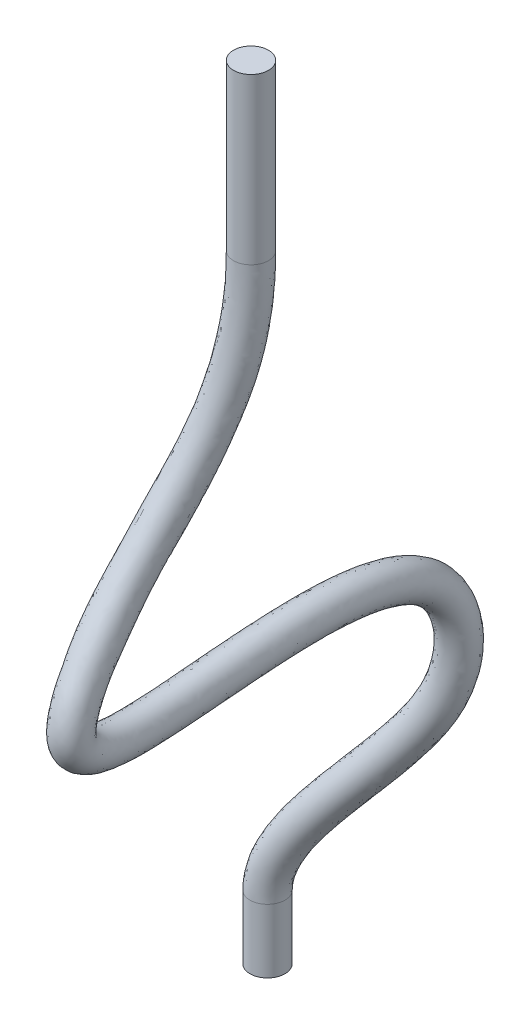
ISO-10303-21;
HEADER;
FILE_DESCRIPTION(('STEP AP214'),'2;1');
FILE_NAME('part.step','',(''),(''),'','','');
FILE_SCHEMA(('AUTOMOTIVE_DESIGN { 1 0 10303 214 1 1 1 1 }'));
ENDSEC;
DATA;
#1=APPLICATION_CONTEXT('core data for automotive mechanical design processes');
#2=APPLICATION_PROTOCOL_DEFINITION('international standard','automotive_design',2000,#1);
#3=PRODUCT_CONTEXT('',#1,'mechanical');
#4=PRODUCT('Part','Part','',(#3));
#5=PRODUCT_RELATED_PRODUCT_CATEGORY('part','',(#4));
#6=PRODUCT_DEFINITION_FORMATION('','',#4);
#7=PRODUCT_DEFINITION_CONTEXT('part definition',#1,'design');
#8=PRODUCT_DEFINITION('design','',#6,#7);
#9=PRODUCT_DEFINITION_SHAPE('','',#8);
#10=(LENGTH_UNIT() NAMED_UNIT(*) SI_UNIT(.MILLI.,.METRE.));
#11=(NAMED_UNIT(*) PLANE_ANGLE_UNIT() SI_UNIT($,.RADIAN.));
#12=(NAMED_UNIT(*) SI_UNIT($,.STERADIAN.) SOLID_ANGLE_UNIT());
#13=UNCERTAINTY_MEASURE_WITH_UNIT(LENGTH_MEASURE(1.E-05),#10,'distance_accuracy_value','');
#14=(GEOMETRIC_REPRESENTATION_CONTEXT(3) GLOBAL_UNCERTAINTY_ASSIGNED_CONTEXT((#13)) GLOBAL_UNIT_ASSIGNED_CONTEXT((#10,
#11,#12)) REPRESENTATION_CONTEXT('',''));
#15=CARTESIAN_POINT('',(0.,0.,0.));
#16=DIRECTION('',(0.,0.,1.));
#17=DIRECTION('',(1.,0.,0.));
#18=AXIS2_PLACEMENT_3D('',#15,#16,#17);
#19=CARTESIAN_POINT('',(-11.9145270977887,-65.5887144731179,-11.1066057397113));
#20=DIRECTION('',(0.,-1.,0.));
#21=DIRECTION('',(0.,0.,-1.));
#22=AXIS2_PLACEMENT_3D('',#19,#20,#21);
#23=CYLINDRICAL_SURFACE('',#22,1.);
#24=CARTESIAN_POINT('',(-11.9145270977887,-65.5887144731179,-11.1066057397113));
#25=DIRECTION('',(0.,1.,0.));
#26=DIRECTION('',(-0.731338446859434,0.,0.682014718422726));
#27=AXIS2_PLACEMENT_3D('',#24,#25,#26);
#28=CIRCLE('',#27,1.);
#29=CARTESIAN_POINT('',(-11.9145270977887,-65.5887144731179,-12.1066057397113));
#30=VERTEX_POINT('',#29);
#31=EDGE_CURVE('E63',#30,#30,#28,.T.);
#32=CARTESIAN_POINT('',(-11.9145270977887,-69.2384942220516,-11.1066057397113));
#33=DIRECTION('',(0.,1.,0.));
#34=DIRECTION('',(-0.731338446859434,0.,0.682014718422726));
#35=AXIS2_PLACEMENT_3D('',#32,#33,#34);
#36=CIRCLE('',#35,1.);
#37=CARTESIAN_POINT('',(-11.9145270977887,-69.2384942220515,-12.1066057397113));
#38=VERTEX_POINT('',#37);
#39=EDGE_CURVE('E11',#38,#38,#36,.T.);
#40=CARTESIAN_POINT('',(-11.9145270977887,-65.5887144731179,-12.1066057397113));
#41=CARTESIAN_POINT('',(-11.9145270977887,-65.6267330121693,-12.1066057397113));
#42=CARTESIAN_POINT('',(-11.9145270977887,-65.6647515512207,-12.1066057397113));
#43=CARTESIAN_POINT('',(-11.9145270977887,-65.7407886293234,-12.1066057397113));
#44=CARTESIAN_POINT('',(-11.9145270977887,-65.7788071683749,-12.1066057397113));
#45=CARTESIAN_POINT('',(-11.9145270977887,-65.8548442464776,-12.1066057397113));
#46=CARTESIAN_POINT('',(-11.9145270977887,-65.892862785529,-12.1066057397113));
#47=CARTESIAN_POINT('',(-11.9145270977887,-65.9688998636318,-12.1066057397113));
#48=CARTESIAN_POINT('',(-11.9145270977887,-66.0069184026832,-12.1066057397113));
#49=CARTESIAN_POINT('',(-11.9145270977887,-66.082955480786,-12.1066057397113));
#50=CARTESIAN_POINT('',(-11.9145270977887,-66.1209740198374,-12.1066057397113));
#51=CARTESIAN_POINT('',(-11.9145270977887,-66.1970110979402,-12.1066057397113));
#52=CARTESIAN_POINT('',(-11.9145270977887,-66.2350296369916,-12.1066057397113));
#53=CARTESIAN_POINT('',(-11.9145270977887,-66.3110667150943,-12.1066057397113));
#54=CARTESIAN_POINT('',(-11.9145270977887,-66.3490852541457,-12.1066057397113));
#55=CARTESIAN_POINT('',(-11.9145270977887,-66.4251223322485,-12.1066057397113));
#56=CARTESIAN_POINT('',(-11.9145270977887,-66.4631408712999,-12.1066057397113));
#57=CARTESIAN_POINT('',(-11.9145270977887,-66.5391779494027,-12.1066057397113));
#58=CARTESIAN_POINT('',(-11.9145270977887,-66.5771964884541,-12.1066057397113));
#59=CARTESIAN_POINT('',(-11.9145270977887,-66.6532335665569,-12.1066057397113));
#60=CARTESIAN_POINT('',(-11.9145270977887,-66.6912521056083,-12.1066057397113));
#61=CARTESIAN_POINT('',(-11.9145270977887,-66.767289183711,-12.1066057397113));
#62=CARTESIAN_POINT('',(-11.9145270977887,-66.8053077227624,-12.1066057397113));
#63=CARTESIAN_POINT('',(-11.9145270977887,-66.8813448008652,-12.1066057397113));
#64=CARTESIAN_POINT('',(-11.9145270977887,-66.9193633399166,-12.1066057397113));
#65=CARTESIAN_POINT('',(-11.9145270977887,-66.9954004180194,-12.1066057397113));
#66=CARTESIAN_POINT('',(-11.9145270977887,-67.0334189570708,-12.1066057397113));
#67=CARTESIAN_POINT('',(-11.9145270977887,-67.1094560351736,-12.1066057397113));
#68=CARTESIAN_POINT('',(-11.9145270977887,-67.147474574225,-12.1066057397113));
#69=CARTESIAN_POINT('',(-11.9145270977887,-67.2235116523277,-12.1066057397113));
#70=CARTESIAN_POINT('',(-11.9145270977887,-67.2615301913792,-12.1066057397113));
#71=CARTESIAN_POINT('',(-11.9145270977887,-67.3375672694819,-12.1066057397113));
#72=CARTESIAN_POINT('',(-11.9145270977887,-67.3755858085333,-12.1066057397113));
#73=CARTESIAN_POINT('',(-11.9145270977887,-67.4516228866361,-12.1066057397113));
#74=CARTESIAN_POINT('',(-11.9145270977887,-67.4896414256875,-12.1066057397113));
#75=CARTESIAN_POINT('',(-11.9145270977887,-67.5656785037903,-12.1066057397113));
#76=CARTESIAN_POINT('',(-11.9145270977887,-67.6036970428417,-12.1066057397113));
#77=CARTESIAN_POINT('',(-11.9145270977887,-67.6797341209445,-12.1066057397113));
#78=CARTESIAN_POINT('',(-11.9145270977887,-67.7177526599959,-12.1066057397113));
#79=CARTESIAN_POINT('',(-11.9145270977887,-67.7937897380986,-12.1066057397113));
#80=CARTESIAN_POINT('',(-11.9145270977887,-67.83180827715,-12.1066057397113));
#81=CARTESIAN_POINT('',(-11.9145270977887,-67.9078453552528,-12.1066057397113));
#82=CARTESIAN_POINT('',(-11.9145270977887,-67.9458638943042,-12.1066057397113));
#83=CARTESIAN_POINT('',(-11.9145270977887,-68.021900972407,-12.1066057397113));
#84=CARTESIAN_POINT('',(-11.9145270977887,-68.0599195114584,-12.1066057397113));
#85=CARTESIAN_POINT('',(-11.9145270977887,-68.1359565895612,-12.1066057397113));
#86=CARTESIAN_POINT('',(-11.9145270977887,-68.1739751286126,-12.1066057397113));
#87=CARTESIAN_POINT('',(-11.9145270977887,-68.2500122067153,-12.1066057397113));
#88=CARTESIAN_POINT('',(-11.9145270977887,-68.2880307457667,-12.1066057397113));
#89=CARTESIAN_POINT('',(-11.9145270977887,-68.3640678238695,-12.1066057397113));
#90=CARTESIAN_POINT('',(-11.9145270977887,-68.4020863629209,-12.1066057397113));
#91=CARTESIAN_POINT('',(-11.9145270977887,-68.4781234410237,-12.1066057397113));
#92=CARTESIAN_POINT('',(-11.9145270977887,-68.5161419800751,-12.1066057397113));
#93=CARTESIAN_POINT('',(-11.9145270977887,-68.5921790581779,-12.1066057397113));
#94=CARTESIAN_POINT('',(-11.9145270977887,-68.6301975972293,-12.1066057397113));
#95=CARTESIAN_POINT('',(-11.9145270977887,-68.706234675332,-12.1066057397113));
#96=CARTESIAN_POINT('',(-11.9145270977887,-68.7442532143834,-12.1066057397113));
#97=CARTESIAN_POINT('',(-11.9145270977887,-68.8202902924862,-12.1066057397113));
#98=CARTESIAN_POINT('',(-11.9145270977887,-68.8583088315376,-12.1066057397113));
#99=CARTESIAN_POINT('',(-11.9145270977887,-68.9343459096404,-12.1066057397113));
#100=CARTESIAN_POINT('',(-11.9145270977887,-68.9723644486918,-12.1066057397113));
#101=CARTESIAN_POINT('',(-11.9145270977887,-69.0484015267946,-12.1066057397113));
#102=CARTESIAN_POINT('',(-11.9145270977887,-69.086420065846,-12.1066057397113));
#103=CARTESIAN_POINT('',(-11.9145270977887,-69.1624571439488,-12.1066057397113));
#104=CARTESIAN_POINT('',(-11.9145270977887,-69.2004756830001,-12.1066057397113));
#105=CARTESIAN_POINT('',(-11.9145270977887,-69.2384942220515,-12.1066057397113));
#106=B_SPLINE_CURVE_WITH_KNOTS('',3,(#40,#41,#42,#43,#44,#45,#46,#47,#48,#49,#50,#51,#52,#53,
#54,#55,#56,#57,#58,#59,#60,#61,#62,#63,#64,#65,#66,#67,#68,#69,#70,#71,#72,#73,#74,#75,#76,#77,
#78,#79,#80,#81,#82,#83,#84,#85,#86,#87,#88,#89,#90,#91,#92,#93,#94,#95,#96,#97,#98,#99,#100,
#101,#102,#103,#104,#105),.UNSPECIFIED.,.F.,.F.,(4,2,2,2,2,2,2,2,2,2,2,2,2,2,2,2,2,2,2,2,2,2,2,
2,2,2,2,2,2,2,2,2,4),(0.,0.114055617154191,0.228111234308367,0.342166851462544,
0.456222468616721,0.570278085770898,0.684333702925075,0.798389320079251,0.912444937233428,
1.0265005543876,1.14055617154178,1.25461178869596,1.36866740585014,1.48272302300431,
1.59677864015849,1.71083425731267,1.82488987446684,1.93894549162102,2.0530011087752,
2.16705672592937,2.28111234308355,2.39516796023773,2.5092235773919,2.62327919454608,
2.73733481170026,2.85139042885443,2.96544604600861,3.07950166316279,3.19355728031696,
3.30761289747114,3.42166851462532,3.53572413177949,3.64977974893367),.UNSPECIFIED.);
#107=EDGE_CURVE('BSEAM49',#30,#38,#106,.T.);
#108=ORIENTED_EDGE('',*,*,#31,.F.);
#109=ORIENTED_EDGE('',*,*,#39,.T.);
#110=ORIENTED_EDGE('',*,*,#107,.T.);
#111=ORIENTED_EDGE('',*,*,#107,.F.);
#112=EDGE_LOOP('',(#108,#110,#109,#111));
#113=FACE_BOUND('',#112,.T.);
#114=ADVANCED_FACE('F49',(#113),#23,.T.);
#115=CARTESIAN_POINT('',(0.,-21.51680856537,1.75));
#116=DIRECTION('',(0.,1.,0.));
#117=DIRECTION('',(-1.,0.,0.));
#118=AXIS2_PLACEMENT_3D('',#115,#116,#117);
#119=CYLINDRICAL_SURFACE('',#118,1.);
#120=CARTESIAN_POINT('',(0.,-21.51680856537,1.75));
#121=DIRECTION('',(0.,1.,0.));
#122=DIRECTION('',(0.,0.,1.));
#123=AXIS2_PLACEMENT_3D('',#120,#121,#122);
#124=CIRCLE('',#123,1.);
#125=CARTESIAN_POINT('',(-1.,-21.51680856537,1.75));
#126=VERTEX_POINT('',#125);
#127=EDGE_CURVE('E59',#126,#126,#124,.T.);
#128=CARTESIAN_POINT('',(0.,-12.0865534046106,1.75));
#129=DIRECTION('',(0.,1.,0.));
#130=DIRECTION('',(0.,0.,1.));
#131=AXIS2_PLACEMENT_3D('',#128,#129,#130);
#132=CIRCLE('',#131,1.);
#133=CARTESIAN_POINT('',(-0.999999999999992,-12.0865534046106,1.75));
#134=VERTEX_POINT('',#133);
#135=EDGE_CURVE('E55',#134,#134,#132,.T.);
#136=CARTESIAN_POINT('',(-1.,-21.51680856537,1.75));
#137=CARTESIAN_POINT('',(-1.,-21.4185767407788,1.75));
#138=CARTESIAN_POINT('',(-0.999999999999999,-21.3203449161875,1.75));
#139=CARTESIAN_POINT('',(-0.999999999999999,-21.1238812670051,1.75));
#140=CARTESIAN_POINT('',(-0.999999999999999,-21.0256494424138,1.75));
#141=CARTESIAN_POINT('',(-0.999999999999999,-20.8291857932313,1.75));
#142=CARTESIAN_POINT('',(-0.999999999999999,-20.7309539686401,1.75));
#143=CARTESIAN_POINT('',(-0.999999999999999,-20.5344903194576,1.75));
#144=CARTESIAN_POINT('',(-0.999999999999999,-20.4362584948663,1.75));
#145=CARTESIAN_POINT('',(-0.999999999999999,-20.2397948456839,1.75));
#146=CARTESIAN_POINT('',(-0.999999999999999,-20.1415630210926,1.75));
#147=CARTESIAN_POINT('',(-0.999999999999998,-19.9450993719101,1.75));
#148=CARTESIAN_POINT('',(-0.999999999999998,-19.8468675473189,1.75));
#149=CARTESIAN_POINT('',(-0.999999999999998,-19.6504038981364,1.75));
#150=CARTESIAN_POINT('',(-0.999999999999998,-19.5521720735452,1.75));
#151=CARTESIAN_POINT('',(-0.999999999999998,-19.3557084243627,1.75));
#152=CARTESIAN_POINT('',(-0.999999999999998,-19.2574765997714,1.75));
#153=CARTESIAN_POINT('',(-0.999999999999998,-19.0610129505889,1.75));
#154=CARTESIAN_POINT('',(-0.999999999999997,-18.9627811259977,1.75));
#155=CARTESIAN_POINT('',(-0.999999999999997,-18.7663174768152,1.75));
#156=CARTESIAN_POINT('',(-0.999999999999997,-18.668085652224,1.75));
#157=CARTESIAN_POINT('',(-0.999999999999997,-18.4716220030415,1.75));
#158=CARTESIAN_POINT('',(-0.999999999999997,-18.3733901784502,1.75));
#159=CARTESIAN_POINT('',(-0.999999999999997,-18.1769265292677,1.75));
#160=CARTESIAN_POINT('',(-0.999999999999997,-18.0786947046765,1.75));
#161=CARTESIAN_POINT('',(-0.999999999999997,-17.882231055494,1.75));
#162=CARTESIAN_POINT('',(-0.999999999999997,-17.7839992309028,1.75));
#163=CARTESIAN_POINT('',(-0.999999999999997,-17.5875355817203,1.75));
#164=CARTESIAN_POINT('',(-0.999999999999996,-17.489303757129,1.75));
#165=CARTESIAN_POINT('',(-0.999999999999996,-17.2928401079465,1.75));
#166=CARTESIAN_POINT('',(-0.999999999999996,-17.1946082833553,1.75));
#167=CARTESIAN_POINT('',(-0.999999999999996,-16.9981446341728,1.75));
#168=CARTESIAN_POINT('',(-0.999999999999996,-16.8999128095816,1.75));
#169=CARTESIAN_POINT('',(-0.999999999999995,-16.7034491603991,1.75));
#170=CARTESIAN_POINT('',(-0.999999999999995,-16.6052173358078,1.75));
#171=CARTESIAN_POINT('',(-0.999999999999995,-16.4087536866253,1.75));
#172=CARTESIAN_POINT('',(-0.999999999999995,-16.3105218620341,1.75));
#173=CARTESIAN_POINT('',(-0.999999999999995,-16.1140582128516,1.75));
#174=CARTESIAN_POINT('',(-0.999999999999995,-16.0158263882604,1.75));
#175=CARTESIAN_POINT('',(-0.999999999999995,-15.8193627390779,1.75));
#176=CARTESIAN_POINT('',(-0.999999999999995,-15.7211309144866,1.75));
#177=CARTESIAN_POINT('',(-0.999999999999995,-15.5246672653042,1.75));
#178=CARTESIAN_POINT('',(-0.999999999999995,-15.4264354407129,1.75));
#179=CARTESIAN_POINT('',(-0.999999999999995,-15.2299717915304,1.75));
#180=CARTESIAN_POINT('',(-0.999999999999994,-15.1317399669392,1.75));
#181=CARTESIAN_POINT('',(-0.999999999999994,-14.9352763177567,1.75));
#182=CARTESIAN_POINT('',(-0.999999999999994,-14.8370444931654,1.75));
#183=CARTESIAN_POINT('',(-0.999999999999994,-14.640580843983,1.75));
#184=CARTESIAN_POINT('',(-0.999999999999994,-14.5423490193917,1.75));
#185=CARTESIAN_POINT('',(-0.999999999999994,-14.3458853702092,1.75));
#186=CARTESIAN_POINT('',(-0.999999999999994,-14.247653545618,1.75));
#187=CARTESIAN_POINT('',(-0.999999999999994,-14.0511898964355,1.75));
#188=CARTESIAN_POINT('',(-0.999999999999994,-13.9529580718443,1.75));
#189=CARTESIAN_POINT('',(-0.999999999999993,-13.7564944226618,1.75));
#190=CARTESIAN_POINT('',(-0.999999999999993,-13.6582625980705,1.75));
#191=CARTESIAN_POINT('',(-0.999999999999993,-13.461798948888,1.75));
#192=CARTESIAN_POINT('',(-0.999999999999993,-13.3635671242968,1.75));
#193=CARTESIAN_POINT('',(-0.999999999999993,-13.1671034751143,1.75));
#194=CARTESIAN_POINT('',(-0.999999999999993,-13.0688716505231,1.75));
#195=CARTESIAN_POINT('',(-0.999999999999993,-12.8724080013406,1.75));
#196=CARTESIAN_POINT('',(-0.999999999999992,-12.7741761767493,1.75));
#197=CARTESIAN_POINT('',(-0.999999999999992,-12.5777125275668,1.75));
#198=CARTESIAN_POINT('',(-0.999999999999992,-12.4794807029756,1.75));
#199=CARTESIAN_POINT('',(-0.999999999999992,-12.2830170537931,1.75));
#200=CARTESIAN_POINT('',(-0.999999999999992,-12.1847852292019,1.75));
#201=CARTESIAN_POINT('',(-0.999999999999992,-12.0865534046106,1.75));
#202=B_SPLINE_CURVE_WITH_KNOTS('',3,(#136,#137,#138,#139,#140,#141,#142,#143,#144,#145,#146,
#147,#148,#149,#150,#151,#152,#153,#154,#155,#156,#157,#158,#159,#160,#161,#162,#163,#164,#165,
#166,#167,#168,#169,#170,#171,#172,#173,#174,#175,#176,#177,#178,#179,#180,#181,#182,#183,#184,
#185,#186,#187,#188,#189,#190,#191,#192,#193,#194,#195,#196,#197,#198,#199,#200,#201),
.UNSPECIFIED.,.F.,.F.,(4,2,2,2,2,2,2,2,2,2,2,2,2,2,2,2,2,2,2,2,2,2,2,2,2,2,2,2,2,2,2,2,4),(0.,
0.294695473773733,0.589390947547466,0.884086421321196,1.17878189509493,1.47347736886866,
1.76817284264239,2.06286831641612,2.35756379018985,2.65225926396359,2.94695473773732,
3.24165021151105,3.53634568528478,3.83104115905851,4.12573663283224,4.42043210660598,
4.71512758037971,5.00982305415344,5.30451852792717,5.5992140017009,5.89390947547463,
6.18860494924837,6.4833004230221,6.77799589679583,7.07269137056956,7.36738684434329,
7.66208231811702,7.95677779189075,8.25147326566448,8.54616873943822,8.84086421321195,
9.13555968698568,9.43025516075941),.UNSPECIFIED.);
#203=EDGE_CURVE('BSEAM72',#126,#134,#202,.T.);
#204=ORIENTED_EDGE('',*,*,#127,.T.);
#205=ORIENTED_EDGE('',*,*,#135,.F.);
#206=ORIENTED_EDGE('',*,*,#203,.T.);
#207=ORIENTED_EDGE('',*,*,#203,.F.);
#208=EDGE_LOOP('',(#204,#206,#205,#207));
#209=FACE_BOUND('',#208,.T.);
#210=ADVANCED_FACE('F72',(#209),#119,.T.);
#211=CARTESIAN_POINT('',(0.,-12.0865534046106,1.75));
#212=DIRECTION('',(0.,1.,0.));
#213=DIRECTION('',(0.,0.,1.));
#214=AXIS2_PLACEMENT_3D('',#211,#212,#213);
#215=PLANE('',#214);
#216=ORIENTED_EDGE('',*,*,#135,.T.);
#217=EDGE_LOOP('',(#216));
#218=FACE_BOUND('',#217,.T.);
#219=ADVANCED_FACE('F76',(#218),#215,.T.);
#220=CARTESIAN_POINT('',(-11.9145270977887,-69.2384942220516,-11.1066057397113));
#221=DIRECTION('',(0.,1.,0.));
#222=DIRECTION('',(-0.731338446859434,0.,0.682014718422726));
#223=AXIS2_PLACEMENT_3D('',#220,#221,#222);
#224=PLANE('',#223);
#225=ORIENTED_EDGE('',*,*,#39,.F.);
#226=EDGE_LOOP('',(#225));
#227=FACE_BOUND('',#226,.T.);
#228=ADVANCED_FACE('F81',(#227),#224,.F.);
#229=CARTESIAN_POINT('',(0.,-21.51680856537,2.75));
#230=CARTESIAN_POINT('',(0.,-23.7016722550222,2.75000000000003));
#231=CARTESIAN_POINT('',(-0.18838190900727,-27.2264612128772,3.1746092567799));
#232=CARTESIAN_POINT('',(-0.615925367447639,-31.9036031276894,4.41224182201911));
#233=CARTESIAN_POINT('',(-1.43502133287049,-35.245711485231,6.2496221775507));
#234=CARTESIAN_POINT('',(-1.98145498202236,-37.7261712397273,8.15064133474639));
#235=CARTESIAN_POINT('',(-1.92527452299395,-39.4223595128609,9.13217794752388));
#236=CARTESIAN_POINT('',(-1.66798440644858,-40.6927677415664,9.49564740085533));
#237=CARTESIAN_POINT('',(-1.62112919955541,-41.5045758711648,9.77228137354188));
#238=CARTESIAN_POINT('',(-1.57922034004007,-42.2812497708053,9.93907264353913));
#239=CARTESIAN_POINT('',(-1.56849593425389,-42.8999221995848,9.95037676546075));
#240=CARTESIAN_POINT('',(-1.57167323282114,-43.2657640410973,9.85701169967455));
#241=CARTESIAN_POINT('',(-1.57892674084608,-43.5036470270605,9.77324155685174));
#242=CARTESIAN_POINT('',(-1.59211542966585,-43.7397231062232,9.66439879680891));
#243=CARTESIAN_POINT('',(-1.62078978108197,-44.0872975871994,9.39889355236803));
#244=CARTESIAN_POINT('',(-1.66374228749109,-44.410972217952,9.01226718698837));
#245=CARTESIAN_POINT('',(-1.74968674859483,-44.8356538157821,8.22756750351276));
#246=CARTESIAN_POINT('',(-1.90008740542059,-45.2050351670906,6.90574456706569));
#247=CARTESIAN_POINT('',(-2.10897618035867,-45.437104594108,4.82576705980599));
#248=CARTESIAN_POINT('',(-2.638423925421,-45.8212689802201,1.35431227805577));
#249=CARTESIAN_POINT('',(-2.96068365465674,-45.6085907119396,-3.89838411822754));
#250=CARTESIAN_POINT('',(-3.35417451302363,-46.1489254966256,-8.33383719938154));
#251=CARTESIAN_POINT('',(-3.38421655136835,-46.8232236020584,-10.5330454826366));
#252=CARTESIAN_POINT('',(-3.38302143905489,-47.266576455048,-11.4422241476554));
#253=CARTESIAN_POINT('',(-3.3266034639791,-47.5871596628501,-11.9089395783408));
#254=CARTESIAN_POINT('',(-3.32698962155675,-47.9724296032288,-12.2613057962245));
#255=CARTESIAN_POINT('',(-3.38494202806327,-48.4260417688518,-12.5061198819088));
#256=CARTESIAN_POINT('',(-3.48782430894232,-49.169901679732,-12.7536335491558));
#257=CARTESIAN_POINT('',(-3.70526847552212,-50.0109895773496,-12.8892063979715));
#258=CARTESIAN_POINT('',(-4.06064442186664,-51.0161620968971,-12.9853012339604));
#259=CARTESIAN_POINT('',(-4.53392967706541,-52.1672069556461,-13.0234236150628));
#260=CARTESIAN_POINT('',(-5.00240919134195,-53.0897609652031,-12.9827283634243));
#261=CARTESIAN_POINT('',(-5.54826799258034,-54.067074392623,-12.8436995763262));
#262=CARTESIAN_POINT('',(-6.94188506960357,-56.3952638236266,-12.2711746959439));
#263=CARTESIAN_POINT('',(-9.62090411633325,-59.2787356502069,-11.3651233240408));
#264=CARTESIAN_POINT('',(-11.4529252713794,-61.9651308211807,-10.8018049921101));
#265=CARTESIAN_POINT('',(-12.0833229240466,-63.1428519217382,-10.6009142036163));
#266=CARTESIAN_POINT('',(-12.5245291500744,-64.2885057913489,-10.4610777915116));
#267=CARTESIAN_POINT('',(-12.6458655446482,-65.25487170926,-10.4245910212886));
#268=CARTESIAN_POINT('',(-12.6458655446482,-65.588714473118,-10.4245910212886));
#269=CARTESIAN_POINT('',(2.,-21.51680856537,2.75));
#270=CARTESIAN_POINT('',(1.99999999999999,-23.8911253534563,2.75000000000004));
#271=CARTESIAN_POINT('',(1.87873881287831,-27.5274572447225,2.8905368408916));
#272=CARTESIAN_POINT('',(0.703257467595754,-32.8297258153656,3.08746290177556));
#273=CARTESIAN_POINT('',(-0.220104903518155,-36.2472936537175,5.03940363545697));
#274=CARTESIAN_POINT('',(-0.200773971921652,-38.4219908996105,7.29808470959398));
#275=CARTESIAN_POINT('',(-0.302601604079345,-40.0657336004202,8.07635026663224));
#276=CARTESIAN_POINT('',(-0.606914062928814,-41.4399451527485,7.95026486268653));
#277=CARTESIAN_POINT('',(-0.701610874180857,-42.1051594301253,8.09829740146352));
#278=CARTESIAN_POINT('',(-0.764734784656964,-42.609900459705,8.12755119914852));
#279=CARTESIAN_POINT('',(-0.796857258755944,-42.8056031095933,8.0839841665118));
#280=CARTESIAN_POINT('',(-0.816394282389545,-42.809666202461,8.05809227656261));
#281=CARTESIAN_POINT('',(-0.820738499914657,-42.8077282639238,8.05329393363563));
#282=CARTESIAN_POINT('',(-0.815068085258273,-42.8021651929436,8.06299245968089));
#283=CARTESIAN_POINT('',(-0.815819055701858,-42.8295942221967,8.04778220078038));
#284=CARTESIAN_POINT('',(-0.821942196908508,-42.9234248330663,7.95384112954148));
#285=CARTESIAN_POINT('',(-0.857102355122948,-43.1522844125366,7.56398820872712));
#286=CARTESIAN_POINT('',(-0.943218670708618,-43.4884295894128,6.53315183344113));
#287=CARTESIAN_POINT('',(-1.12130221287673,-43.6971707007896,4.62399609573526));
#288=CARTESIAN_POINT('',(-1.13046899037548,-44.4608854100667,1.22597269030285));
#289=CARTESIAN_POINT('',(-1.80483616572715,-43.9765478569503,-4.02047693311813));
#290=CARTESIAN_POINT('',(-1.909727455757,-44.7756321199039,-8.58754470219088));
#291=CARTESIAN_POINT('',(-1.94877414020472,-45.5174992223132,-11.0236020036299));
#292=CARTESIAN_POINT('',(-1.91982063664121,-46.0529600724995,-12.0748285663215));
#293=CARTESIAN_POINT('',(-1.89604044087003,-46.4441730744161,-12.7254394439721));
#294=CARTESIAN_POINT('',(-1.81313211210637,-47.0064220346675,-13.1430174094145));
#295=CARTESIAN_POINT('',(-1.67086170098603,-47.7448017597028,-13.3346811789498));
#296=CARTESIAN_POINT('',(-1.58225700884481,-48.8433540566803,-13.3405154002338));
#297=CARTESIAN_POINT('',(-1.67849342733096,-50.0038495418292,-13.0147973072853));
#298=CARTESIAN_POINT('',(-2.09845996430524,-51.2492795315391,-12.4870180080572));
#299=CARTESIAN_POINT('',(-2.83297675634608,-52.5142726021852,-11.9671690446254));
#300=CARTESIAN_POINT('',(-3.5582085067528,-53.4571366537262,-11.6480165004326));
#301=CARTESIAN_POINT('',(-4.25992410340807,-54.4843074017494,-11.3651459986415));
#302=CARTESIAN_POINT('',(-5.71325786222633,-57.0158689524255,-10.8214159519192));
#303=CARTESIAN_POINT('',(-8.40093996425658,-59.9222657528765,-9.9081928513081));
#304=CARTESIAN_POINT('',(-10.1977052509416,-62.4277176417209,-9.31569763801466));
#305=CARTESIAN_POINT('',(-10.7878296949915,-63.5364649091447,-9.12242319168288));
#306=CARTESIAN_POINT('',(-11.1796756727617,-64.4488207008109,-8.99484272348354));
#307=CARTESIAN_POINT('',(-11.2818361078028,-65.4889099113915,-8.96191412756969));
#308=CARTESIAN_POINT('',(-11.2818361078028,-65.588714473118,-8.9619141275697));
#309=CARTESIAN_POINT('',(2.,-21.51680856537,0.75));
#310=CARTESIAN_POINT('',(2.,-23.8911253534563,0.750000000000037));
#311=CARTESIAN_POINT('',(1.54568217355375,-28.0365850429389,0.850517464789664));
#312=CARTESIAN_POINT('',(-0.840872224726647,-33.0866570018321,1.71667466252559));
#313=CARTESIAN_POINT('',(-1.76478420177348,-36.6880192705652,3.86207813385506));
#314=CARTESIAN_POINT('',(-1.28588035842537,-39.3216916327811,5.75309139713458));
#315=CARTESIAN_POINT('',(-1.537375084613,-40.8982615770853,6.68419966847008));
#316=CARTESIAN_POINT('',(-2.32130576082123,-41.9307014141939,7.00793758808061));
#317=CARTESIAN_POINT('',(-2.47459473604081,-42.4597992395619,7.24642973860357));
#318=CARTESIAN_POINT('',(-2.59297265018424,-42.7840213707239,7.32319354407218));
#319=CARTESIAN_POINT('',(-2.64221196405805,-42.7517781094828,7.29877205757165));
#320=CARTESIAN_POINT('',(-2.66760190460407,-42.5690883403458,7.33746642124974));
#321=CARTESIAN_POINT('',(-2.66971828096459,-42.4399360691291,7.38161188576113));
#322=CARTESIAN_POINT('',(-2.65472778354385,-42.3020949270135,7.44730383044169));
#323=CARTESIAN_POINT('',(-2.64059084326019,-42.1557669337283,7.56575405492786));
#324=CARTESIAN_POINT('',(-2.62736581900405,-42.121183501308,7.62435673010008));
#325=CARTESIAN_POINT('',(-2.63620187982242,-42.235193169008,7.44081987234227));
#326=CARTESIAN_POINT('',(-2.6848158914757,-42.5092061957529,6.5573408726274));
#327=CARTESIAN_POINT('',(-2.86056944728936,-42.6957251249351,4.73160475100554));
#328=CARTESIAN_POINT('',(-2.4851211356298,-42.94720159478,1.34244792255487));
#329=CARTESIAN_POINT('',(-3.43601052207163,-42.8186050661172,-3.90274877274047));
#330=CARTESIAN_POINT('',(-3.29290701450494,-43.3111207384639,-8.71344257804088));
#331=CARTESIAN_POINT('',(-3.34215410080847,-44.1650106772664,-11.522599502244));
#332=CARTESIAN_POINT('',(-3.2806490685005,-44.7929219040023,-12.8461442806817));
#333=CARTESIAN_POINT('',(-3.29335901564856,-45.3763028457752,-13.6953484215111));
#334=CARTESIAN_POINT('',(-3.1053976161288,-46.0860513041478,-14.3672977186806));
#335=CARTESIAN_POINT('',(-2.71532521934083,-46.9276924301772,-14.8716274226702));
#336=CARTESIAN_POINT('',(-2.2308461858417,-48.2805570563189,-15.1763438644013));
#337=CARTESIAN_POINT('',(-1.79410365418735,-49.7105127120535,-15.025068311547));
#338=CARTESIAN_POINT('',(-1.59282137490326,-51.3084920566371,-14.465363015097));
#339=CARTESIAN_POINT('',(-1.83898054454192,-52.9620947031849,-13.6900638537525));
#340=CARTESIAN_POINT('',(-2.40115606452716,-54.2013362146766,-13.1015695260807));
#341=CARTESIAN_POINT('',(-3.07183864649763,-55.4467143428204,-12.6655459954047));
#342=CARTESIAN_POINT('',(-4.78895594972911,-58.2489649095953,-12.1130948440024));
#343=CARTESIAN_POINT('',(-7.46152555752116,-61.1269988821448,-11.2101989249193));
#344=CARTESIAN_POINT('',(-9.02491803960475,-63.4121378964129,-10.6107854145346));
#345=CARTESIAN_POINT('',(-9.50310302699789,-64.3078029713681,-10.4423399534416));
#346=CARTESIAN_POINT('',(-9.77161054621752,-65.0235731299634,-10.3468595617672));
#347=CARTESIAN_POINT('',(-9.81915921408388,-65.4889099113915,-10.3259435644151));
#348=CARTESIAN_POINT('',(-9.81915921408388,-65.5887144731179,-10.3259435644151));
#349=CARTESIAN_POINT('',(0.,-21.51680856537,0.75));
#350=CARTESIAN_POINT('',(0.,-23.7963988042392,0.750000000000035));
#351=CARTESIAN_POINT('',(-0.521438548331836,-27.6916077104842,1.13458988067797));
#352=CARTESIAN_POINT('',(-2.16005505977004,-32.1723790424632,3.04145358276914));
#353=CARTESIAN_POINT('',(-2.97970063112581,-35.6854035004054,5.07229667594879));
#354=CARTESIAN_POINT('',(-3.06656136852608,-38.6250981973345,6.60564802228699));
#355=CARTESIAN_POINT('',(-3.1600480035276,-40.2549631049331,7.74002734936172));
#356=CARTESIAN_POINT('',(-3.382376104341,-41.1835105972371,8.55332012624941));
#357=CARTESIAN_POINT('',(-3.39411306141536,-41.8592192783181,8.92041371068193));
#358=CARTESIAN_POINT('',(-3.40745820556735,-42.4553696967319,9.13471498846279));
#359=CARTESIAN_POINT('',(-3.41385063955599,-42.8460973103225,9.1651646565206));
#360=CARTESIAN_POINT('',(-3.42288085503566,-43.0251861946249,9.13638584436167));
#361=CARTESIAN_POINT('',(-3.42790652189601,-43.1358548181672,9.10155950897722));
#362=CARTESIAN_POINT('',(-3.43177512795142,-43.2396528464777,9.04871016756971));
#363=CARTESIAN_POINT('',(-3.4455615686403,-43.413470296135,8.91686540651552));
#364=CARTESIAN_POINT('',(-3.46916590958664,-43.6087308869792,8.68278278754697));
#365=CARTESIAN_POINT('',(-3.52878627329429,-43.9185625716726,8.1043991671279));
#366=CARTESIAN_POINT('',(-3.64168462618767,-44.2258117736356,6.92993360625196));
#367=CARTESIAN_POINT('',(-3.84824341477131,-44.4356590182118,4.93337571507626));
#368=CARTESIAN_POINT('',(-3.99307607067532,-44.3075851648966,1.47078751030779));
#369=CARTESIAN_POINT('',(-4.59185801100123,-44.4506479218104,-3.78065595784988));
#370=CARTESIAN_POINT('',(-4.73735407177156,-44.6844141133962,-8.45973507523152));
#371=CARTESIAN_POINT('',(-4.7775965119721,-45.4707350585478,-11.0320429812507));
#372=CARTESIAN_POINT('',(-4.74384987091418,-46.0065382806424,-12.2135398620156));
#373=CARTESIAN_POINT('',(-4.72392203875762,-46.5192894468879,-12.8788485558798));
#374=CARTESIAN_POINT('',(-4.61925512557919,-47.0520588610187,-13.4855861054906));
#375=CARTESIAN_POINT('',(-4.42940554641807,-47.6089323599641,-14.0430661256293));
#376=CARTESIAN_POINT('',(-4.13641348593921,-48.6071049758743,-14.5894620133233));
#377=CARTESIAN_POINT('',(-3.82087870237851,-49.7176516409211,-14.8994774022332));
#378=CARTESIAN_POINT('',(-3.55500583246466,-51.0753793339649,-14.9636462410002));
#379=CARTESIAN_POINT('',(-3.53993346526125,-52.6150059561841,-14.7463184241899));
#380=CARTESIAN_POINT('',(-3.84535674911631,-53.8340081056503,-14.4362813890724));
#381=CARTESIAN_POINT('',(-4.3601825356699,-55.0294447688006,-14.1440995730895));
#382=CARTESIAN_POINT('',(-6.01758315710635,-57.627692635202,-13.5628535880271));
#383=CARTESIAN_POINT('',(-8.68148970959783,-60.4894026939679,-12.667129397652));
#384=CARTESIAN_POINT('',(-10.2801380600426,-62.9458338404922,-12.09689276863));
#385=CARTESIAN_POINT('',(-10.7985962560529,-63.9286929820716,-11.9208309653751));
#386=CARTESIAN_POINT('',(-11.1164640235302,-64.8089634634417,-11.8130946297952));
#387=CARTESIAN_POINT('',(-11.1831886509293,-65.3718908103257,-11.788620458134));
#388=CARTESIAN_POINT('',(-11.1831886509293,-65.588714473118,-11.788620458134));
#389=CARTESIAN_POINT('',(-2.,-21.51680856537,0.75));
#390=CARTESIAN_POINT('',(-2.,-23.7016722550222,0.750000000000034));
#391=CARTESIAN_POINT('',(-2.58855927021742,-27.3466303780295,1.41866229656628));
#392=CARTESIAN_POINT('',(-3.47923789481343,-31.2581010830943,4.36623250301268));
#393=CARTESIAN_POINT('',(-4.19461706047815,-34.6827877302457,6.28251521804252));
#394=CARTESIAN_POINT('',(-4.84724237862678,-37.9285047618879,7.4582046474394));
#395=CARTESIAN_POINT('',(-4.7827209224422,-39.611664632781,8.79585503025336));
#396=CARTESIAN_POINT('',(-4.44344644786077,-40.4363197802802,10.0987026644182));
#397=CARTESIAN_POINT('',(-4.31363138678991,-41.2586393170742,10.5943976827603));
#398=CARTESIAN_POINT('',(-4.22194376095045,-42.1267180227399,10.9462364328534));
#399=CARTESIAN_POINT('',(-4.18548931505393,-42.9404165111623,11.0315572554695));
#400=CARTESIAN_POINT('',(-4.17815980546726,-43.481284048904,10.9353052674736));
#401=CARTESIAN_POINT('',(-4.18609476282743,-43.8317735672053,10.8215071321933));
#402=CARTESIAN_POINT('',(-4.20882247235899,-44.1772107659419,10.6501165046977));
#403=CARTESIAN_POINT('',(-4.25053229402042,-44.6711736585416,10.2679767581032));
#404=CARTESIAN_POINT('',(-4.31096600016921,-45.0962782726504,9.74120884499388));
#405=CARTESIAN_POINT('',(-4.42137066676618,-45.6019319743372,8.76797846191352));
#406=CARTESIAN_POINT('',(-4.59855336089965,-45.9424173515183,7.30252633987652));
#407=CARTESIAN_POINT('',(-4.83591738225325,-46.1755929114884,5.13514667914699));
#408=CARTESIAN_POINT('',(-5.50103100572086,-45.6679687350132,1.5991270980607));
#409=CARTESIAN_POINT('',(-5.74770549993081,-46.0826907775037,-3.65856314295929));
#410=CARTESIAN_POINT('',(-6.18180112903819,-46.0577074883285,-8.20602757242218));
#411=CARTESIAN_POINT('',(-6.21303892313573,-46.7764594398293,-10.5414864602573));
#412=CARTESIAN_POINT('',(-6.20705067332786,-47.2201546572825,-11.5809354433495));
#413=CARTESIAN_POINT('',(-6.15448506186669,-47.6622760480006,-12.0623486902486));
#414=CARTESIAN_POINT('',(-6.13311263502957,-48.0180664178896,-12.6038744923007));
#415=CARTESIAN_POINT('',(-6.14348587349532,-48.290172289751,-13.2145048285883));
#416=CARTESIAN_POINT('',(-6.04198078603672,-48.9336528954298,-14.0025801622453));
#417=CARTESIAN_POINT('',(-5.84765375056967,-49.7247905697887,-14.7738864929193));
#418=CARTESIAN_POINT('',(-5.51719029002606,-50.8422666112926,-15.4619294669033));
#419=CARTESIAN_POINT('',(-5.24088638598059,-52.2679172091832,-15.8025729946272));
#420=CARTESIAN_POINT('',(-5.28955743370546,-53.466679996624,-15.7709932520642));
#421=CARTESIAN_POINT('',(-5.64852642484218,-54.6121751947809,-15.6226531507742));
#422=CARTESIAN_POINT('',(-7.24621036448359,-57.0064203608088,-15.0126123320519));
#423=CARTESIAN_POINT('',(-9.90145386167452,-59.8518065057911,-14.1240598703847));
#424=CARTESIAN_POINT('',(-11.5353580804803,-62.4795297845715,-13.5830001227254));
#425=CARTESIAN_POINT('',(-12.094089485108,-63.5495829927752,-13.3993219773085));
#426=CARTESIAN_POINT('',(-12.461317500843,-64.5943537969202,-13.2793296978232));
#427=CARTESIAN_POINT('',(-12.5472180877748,-65.25487170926,-13.2512973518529));
#428=CARTESIAN_POINT('',(-12.5472180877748,-65.588714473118,-13.2512973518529));
#429=CARTESIAN_POINT('',(-2.,-21.51680856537,2.75));
#430=CARTESIAN_POINT('',(-2.,-23.512219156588,2.75000000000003));
#431=CARTESIAN_POINT('',(-2.25550263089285,-26.925465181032,3.45868167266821));
#432=CARTESIAN_POINT('',(-1.93510820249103,-30.9774804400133,5.73702074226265));
#433=CARTESIAN_POINT('',(-2.64993776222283,-34.2441293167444,7.45984071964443));
#434=CARTESIAN_POINT('',(-3.76213599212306,-37.0303515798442,9.0031979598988));
#435=CARTESIAN_POINT('',(-3.54794744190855,-38.7789854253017,10.1880056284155));
#436=CARTESIAN_POINT('',(-2.72905474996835,-39.9455903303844,11.0410299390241));
#437=CARTESIAN_POINT('',(-2.54064752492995,-40.9039923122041,11.4462653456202));
#438=CARTESIAN_POINT('',(-2.39370589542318,-41.9525990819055,11.7505940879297));
#439=CARTESIAN_POINT('',(-2.34013460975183,-42.9942412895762,11.8167693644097));
#440=CARTESIAN_POINT('',(-2.32695218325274,-43.7218618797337,11.6559311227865));
#441=CARTESIAN_POINT('',(-2.3371149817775,-44.1995657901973,11.4931891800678));
#442=CARTESIAN_POINT('',(-2.36916277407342,-44.6772810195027,11.2658051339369));
#443=CARTESIAN_POINT('',(-2.42576050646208,-45.345000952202,10.7500049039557));
#444=CARTESIAN_POINT('',(-2.50554237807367,-45.8985196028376,10.0706932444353));
#445=CARTESIAN_POINT('',(-2.64227114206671,-46.5190232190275,8.89114679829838));
#446=CARTESIAN_POINT('',(-2.85695614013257,-46.9216407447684,7.27833730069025));
#447=CARTESIAN_POINT('',(-3.09665014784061,-47.1770384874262,5.02753802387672));
#448=CARTESIAN_POINT('',(-4.14637886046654,-47.1816525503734,1.48265186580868));
#449=CARTESIAN_POINT('',(-4.11653114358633,-47.2406335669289,-3.77629130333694));
#450=CARTESIAN_POINT('',(-4.79862157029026,-47.5222188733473,-8.08012969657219));
#451=CARTESIAN_POINT('',(-4.81965896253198,-48.1289479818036,-10.0424889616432));
#452=CARTESIAN_POINT('',(-4.84622224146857,-48.4801928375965,-10.8096197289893));
#453=CARTESIAN_POINT('',(-4.75716648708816,-48.7301462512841,-11.0924397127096));
#454=CARTESIAN_POINT('',(-4.84084713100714,-48.93843717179,-11.3795941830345));
#455=CARTESIAN_POINT('',(-5.09902235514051,-49.1072817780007,-11.6775585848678));
#456=CARTESIAN_POINT('',(-5.39339160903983,-49.4964493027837,-12.1667516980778));
#457=CARTESIAN_POINT('',(-5.73204352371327,-50.01812961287,-12.7636154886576));
#458=CARTESIAN_POINT('',(-6.02282887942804,-50.783044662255,-13.4835844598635));
#459=CARTESIAN_POINT('',(-6.23488259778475,-51.820141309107,-14.0796781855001));
#460=CARTESIAN_POINT('',(-6.4466098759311,-52.7223852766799,-14.3174402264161));
#461=CARTESIAN_POINT('',(-6.83661188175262,-53.6498413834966,-14.322253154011));
#462=CARTESIAN_POINT('',(-8.17051227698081,-55.7746586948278,-13.7209334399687));
#463=CARTESIAN_POINT('',(-10.8408682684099,-58.6352055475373,-12.8220537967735));
#464=CARTESIAN_POINT('',(-12.7081452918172,-61.5025440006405,-12.2879123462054));
#465=CARTESIAN_POINT('',(-13.3788161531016,-62.7492389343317,-12.0794052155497));
#466=CARTESIAN_POINT('',(-13.8693826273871,-64.1281908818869,-11.9273128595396));
#467=CARTESIAN_POINT('',(-14.0098949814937,-65.0208335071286,-11.8872679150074));
#468=CARTESIAN_POINT('',(-14.0098949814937,-65.588714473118,-11.8872679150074));
#469=CARTESIAN_POINT('',(0.,-21.51680856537,2.75));
#470=CARTESIAN_POINT('',(0.,-23.7016722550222,2.75000000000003));
#471=CARTESIAN_POINT('',(-0.18838190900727,-27.2264612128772,3.1746092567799));
#472=CARTESIAN_POINT('',(-0.615925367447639,-31.9036031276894,4.41224182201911));
#473=CARTESIAN_POINT('',(-1.43502133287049,-35.245711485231,6.2496221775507));
#474=CARTESIAN_POINT('',(-1.98145498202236,-37.7261712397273,8.15064133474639));
#475=CARTESIAN_POINT('',(-1.92527452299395,-39.4223595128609,9.13217794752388));
#476=CARTESIAN_POINT('',(-1.66798440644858,-40.6927677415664,9.49564740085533));
#477=CARTESIAN_POINT('',(-1.62112919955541,-41.5045758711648,9.77228137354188));
#478=CARTESIAN_POINT('',(-1.57922034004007,-42.2812497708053,9.93907264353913));
#479=CARTESIAN_POINT('',(-1.56849593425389,-42.8999221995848,9.95037676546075));
#480=CARTESIAN_POINT('',(-1.57167323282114,-43.2657640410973,9.85701169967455));
#481=CARTESIAN_POINT('',(-1.57892674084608,-43.5036470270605,9.77324155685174));
#482=CARTESIAN_POINT('',(-1.59211542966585,-43.7397231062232,9.66439879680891));
#483=CARTESIAN_POINT('',(-1.62078978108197,-44.0872975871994,9.39889355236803));
#484=CARTESIAN_POINT('',(-1.66374228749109,-44.410972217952,9.01226718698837));
#485=CARTESIAN_POINT('',(-1.74968674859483,-44.8356538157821,8.22756750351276));
#486=CARTESIAN_POINT('',(-1.90008740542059,-45.2050351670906,6.90574456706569));
#487=CARTESIAN_POINT('',(-2.10897618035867,-45.437104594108,4.82576705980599));
#488=CARTESIAN_POINT('',(-2.638423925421,-45.8212689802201,1.35431227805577));
#489=CARTESIAN_POINT('',(-2.96068365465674,-45.6085907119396,-3.89838411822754));
#490=CARTESIAN_POINT('',(-3.35417451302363,-46.1489254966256,-8.33383719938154));
#491=CARTESIAN_POINT('',(-3.38421655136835,-46.8232236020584,-10.5330454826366));
#492=CARTESIAN_POINT('',(-3.38302143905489,-47.266576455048,-11.4422241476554));
#493=CARTESIAN_POINT('',(-3.3266034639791,-47.5871596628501,-11.9089395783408));
#494=CARTESIAN_POINT('',(-3.32698962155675,-47.9724296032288,-12.2613057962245));
#495=CARTESIAN_POINT('',(-3.38494202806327,-48.4260417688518,-12.5061198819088));
#496=CARTESIAN_POINT('',(-3.48782430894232,-49.169901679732,-12.7536335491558));
#497=CARTESIAN_POINT('',(-3.70526847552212,-50.0109895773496,-12.8892063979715));
#498=CARTESIAN_POINT('',(-4.06064442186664,-51.0161620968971,-12.9853012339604));
#499=CARTESIAN_POINT('',(-4.53392967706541,-52.1672069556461,-13.0234236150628));
#500=CARTESIAN_POINT('',(-5.00240919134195,-53.0897609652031,-12.9827283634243));
#501=CARTESIAN_POINT('',(-5.54826799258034,-54.067074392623,-12.8436995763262));
#502=CARTESIAN_POINT('',(-6.94188506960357,-56.3952638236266,-12.2711746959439));
#503=CARTESIAN_POINT('',(-9.62090411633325,-59.2787356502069,-11.3651233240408));
#504=CARTESIAN_POINT('',(-11.4529252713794,-61.9651308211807,-10.8018049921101));
#505=CARTESIAN_POINT('',(-12.0833229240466,-63.1428519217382,-10.6009142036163));
#506=CARTESIAN_POINT('',(-12.5245291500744,-64.2885057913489,-10.4610777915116));
#507=CARTESIAN_POINT('',(-12.6458655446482,-65.25487170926,-10.4245910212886));
#508=CARTESIAN_POINT('',(-12.6458655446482,-65.588714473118,-10.4245910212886));
#509=(BOUNDED_SURFACE() B_SPLINE_SURFACE(3,3,((#229,#230,#231,#232,#233,#234,#235,#236,#237,
#238,#239,#240,#241,#242,#243,#244,#245,#246,#247,#248,#249,#250,#251,#252,#253,#254,#255,#256,
#257,#258,#259,#260,#261,#262,#263,#264,#265,#266,#267,#268),(#269,#270,#271,#272,#273,#274,
#275,#276,#277,#278,#279,#280,#281,#282,#283,#284,#285,#286,#287,#288,#289,#290,#291,#292,#293,
#294,#295,#296,#297,#298,#299,#300,#301,#302,#303,#304,#305,#306,#307,#308),(#309,#310,#311,
#312,#313,#314,#315,#316,#317,#318,#319,#320,#321,#322,#323,#324,#325,#326,#327,#328,#329,#330,
#331,#332,#333,#334,#335,#336,#337,#338,#339,#340,#341,#342,#343,#344,#345,#346,#347,#348),
(#349,#350,#351,#352,#353,#354,#355,#356,#357,#358,#359,#360,#361,#362,#363,#364,#365,#366,#367,
#368,#369,#370,#371,#372,#373,#374,#375,#376,#377,#378,#379,#380,#381,#382,#383,#384,#385,#386,
#387,#388),(#389,#390,#391,#392,#393,#394,#395,#396,#397,#398,#399,#400,#401,#402,#403,#404,
#405,#406,#407,#408,#409,#410,#411,#412,#413,#414,#415,#416,#417,#418,#419,#420,#421,#422,#423,
#424,#425,#426,#427,#428),(#429,#430,#431,#432,#433,#434,#435,#436,#437,#438,#439,#440,#441,
#442,#443,#444,#445,#446,#447,#448,#449,#450,#451,#452,#453,#454,#455,#456,#457,#458,#459,#460,
#461,#462,#463,#464,#465,#466,#467,#468),(#469,#470,#471,#472,#473,#474,#475,#476,#477,#478,
#479,#480,#481,#482,#483,#484,#485,#486,#487,#488,#489,#490,#491,#492,#493,#494,#495,#496,#497,
#498,#499,#500,#501,#502,#503,#504,#505,#506,#507,#508)),.UNSPECIFIED.,.T.,.F.,
.F.) B_SPLINE_SURFACE_WITH_KNOTS((4,3,4),(4,1,1,1,1,1,1,1,1,1,1,1,1,1,1,1,1,1,1,1,1,1,1,1,1,1,1,
1,1,1,1,1,1,1,1,1,1,4),(0.,0.5,1.),(0.,0.0833333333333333,0.166666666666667,0.250000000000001,
0.294559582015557,0.32875,0.344218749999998,0.3596875,0.375156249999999,0.390625,
0.39799192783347,0.3984375,0.40625,0.4140625,0.42578125,0.4375,0.4669,0.496300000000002,0.5257,
0.595,0.6643,0.68245,0.7006,0.718329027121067,0.71875,0.736328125,0.75390625,0.771484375,
0.7890625,0.8125,0.833437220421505,0.8359375,0.859375,0.938125,0.953593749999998,0.9690625,
0.98453125,1.),.UNSPECIFIED.) GEOMETRIC_REPRESENTATION_ITEM() RATIONAL_B_SPLINE_SURFACE(((1.,1.,
1.,1.,1.,1.,1.,1.,1.,1.,1.,1.,1.,1.,1.,1.,1.,1.,1.,1.,1.,1.,1.,1.,1.,1.,1.,1.,1.,1.,1.,1.,1.,1.,
1.,1.,1.,0.999999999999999,1.,1.),(0.333333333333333,0.333333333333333,0.333333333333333,
0.333333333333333,0.333333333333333,0.333333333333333,0.333333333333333,0.333333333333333,
0.333333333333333,0.333333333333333,0.333333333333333,0.333333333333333,0.333333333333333,
0.333333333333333,0.333333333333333,0.333333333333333,0.333333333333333,0.333333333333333,
0.333333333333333,0.333333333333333,0.333333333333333,0.333333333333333,0.333333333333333,
0.333333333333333,0.333333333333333,0.333333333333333,0.333333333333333,0.333333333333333,
0.333333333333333,0.333333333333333,0.333333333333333,0.333333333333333,0.333333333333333,
0.333333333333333,0.333333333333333,0.333333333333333,0.333333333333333,0.333333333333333,
0.333333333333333,0.333333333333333),(0.333333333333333,0.333333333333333,0.333333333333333,
0.333333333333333,0.333333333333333,0.333333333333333,0.333333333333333,0.333333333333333,
0.333333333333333,0.333333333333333,0.333333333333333,0.333333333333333,0.333333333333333,
0.333333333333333,0.333333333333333,0.333333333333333,0.333333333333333,0.333333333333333,
0.333333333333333,0.333333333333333,0.333333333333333,0.333333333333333,0.333333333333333,
0.333333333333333,0.333333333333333,0.333333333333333,0.333333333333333,0.333333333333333,
0.333333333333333,0.333333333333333,0.333333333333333,0.333333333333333,0.333333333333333,
0.333333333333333,0.333333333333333,0.333333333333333,0.333333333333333,0.333333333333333,
0.333333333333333,0.333333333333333),(1.,1.,1.,1.,1.,1.,1.,1.,1.,1.,1.,1.,1.,1.,1.,1.,1.,1.,1.,
1.,1.,1.,1.,1.,1.,1.,1.,1.,1.,1.,1.,1.,1.,1.,1.,1.,1.,0.999999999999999,1.,1.),
(0.333333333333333,0.333333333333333,0.333333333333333,0.333333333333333,0.333333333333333,
0.333333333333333,0.333333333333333,0.333333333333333,0.333333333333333,0.333333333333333,
0.333333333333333,0.333333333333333,0.333333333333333,0.333333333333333,0.333333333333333,
0.333333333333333,0.333333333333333,0.333333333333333,0.333333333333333,0.333333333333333,
0.333333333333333,0.333333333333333,0.333333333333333,0.333333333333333,0.333333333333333,
0.333333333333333,0.333333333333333,0.333333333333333,0.333333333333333,0.333333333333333,
0.333333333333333,0.333333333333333,0.333333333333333,0.333333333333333,0.333333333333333,
0.333333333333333,0.333333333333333,0.333333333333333,0.333333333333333,0.333333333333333),
(0.333333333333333,0.333333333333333,0.333333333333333,0.333333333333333,0.333333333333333,
0.333333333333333,0.333333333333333,0.333333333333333,0.333333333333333,0.333333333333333,
0.333333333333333,0.333333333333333,0.333333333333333,0.333333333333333,0.333333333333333,
0.333333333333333,0.333333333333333,0.333333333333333,0.333333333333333,0.333333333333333,
0.333333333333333,0.333333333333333,0.333333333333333,0.333333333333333,0.333333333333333,
0.333333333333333,0.333333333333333,0.333333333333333,0.333333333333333,0.333333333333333,
0.333333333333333,0.333333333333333,0.333333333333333,0.333333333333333,0.333333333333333,
0.333333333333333,0.333333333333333,0.333333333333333,0.333333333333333,0.333333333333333),(1.,
1.,1.,1.,1.,1.,1.,1.,1.,1.,1.,1.,1.,1.,1.,1.,1.,1.,1.,1.,1.,1.,1.,1.,1.,1.,1.,1.,1.,1.,1.,1.,1.,
1.,1.,1.,1.,0.999999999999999,1.,1.))) REPRESENTATION_ITEM('') SURFACE());
#510=ORIENTED_EDGE('',*,*,#127,.F.);
#511=EDGE_LOOP('',(#510));
#512=FACE_BOUND('',#511,.T.);
#513=ORIENTED_EDGE('',*,*,#31,.T.);
#514=EDGE_LOOP('',(#513));
#515=FACE_BOUND('',#514,.T.);
#516=ADVANCED_FACE('F69',(#512,#515),#509,.F.);
#517=CLOSED_SHELL('',(#114,#210,#219,#228,#516));
#518=MANIFOLD_SOLID_BREP('B2',#517);
#519=ADVANCED_BREP_SHAPE_REPRESENTATION('',(#18,#518),#14);
#520=SHAPE_DEFINITION_REPRESENTATION(#9,#519);
ENDSEC;
END-ISO-10303-21;
